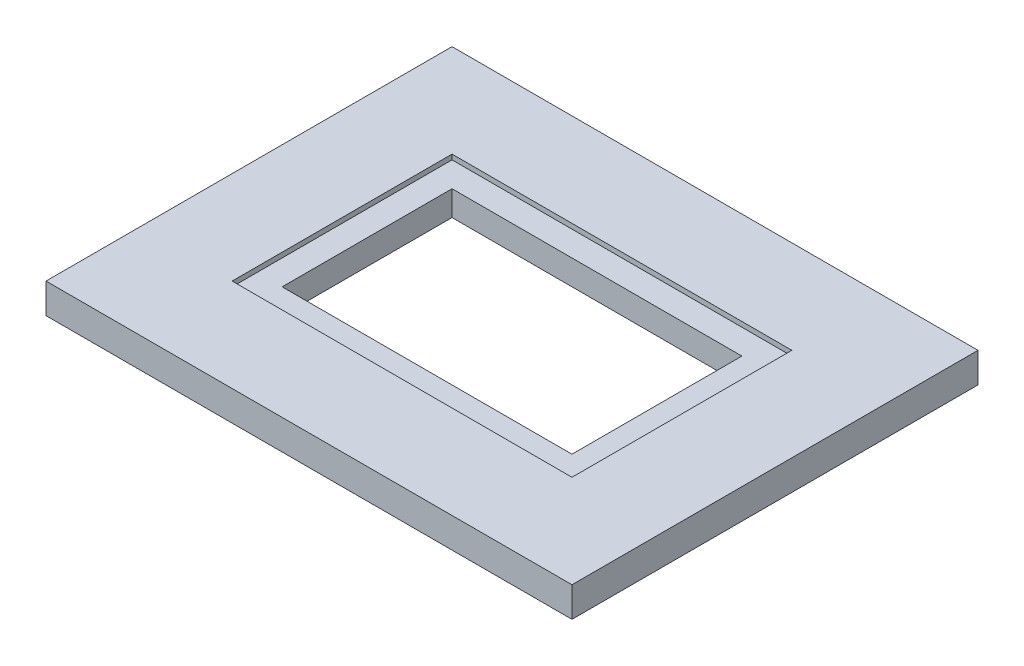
ISO-10303-21;
HEADER;
FILE_DESCRIPTION(('STEP AP214'),'2;1');
FILE_NAME('part.step','',(''),(''),'','','');
FILE_SCHEMA(('AUTOMOTIVE_DESIGN { 1 0 10303 214 1 1 1 1 }'));
ENDSEC;
DATA;
#1=APPLICATION_CONTEXT('core data for automotive mechanical design processes');
#2=APPLICATION_PROTOCOL_DEFINITION('international standard','automotive_design',2000,#1);
#3=PRODUCT_CONTEXT('',#1,'mechanical');
#4=PRODUCT('Part','Part','',(#3));
#5=PRODUCT_RELATED_PRODUCT_CATEGORY('part','',(#4));
#6=PRODUCT_DEFINITION_FORMATION('','',#4);
#7=PRODUCT_DEFINITION_CONTEXT('part definition',#1,'design');
#8=PRODUCT_DEFINITION('design','',#6,#7);
#9=PRODUCT_DEFINITION_SHAPE('','',#8);
#10=(LENGTH_UNIT() NAMED_UNIT(*) SI_UNIT(.MILLI.,.METRE.));
#11=(NAMED_UNIT(*) PLANE_ANGLE_UNIT() SI_UNIT($,.RADIAN.));
#12=(NAMED_UNIT(*) SI_UNIT($,.STERADIAN.) SOLID_ANGLE_UNIT());
#13=UNCERTAINTY_MEASURE_WITH_UNIT(LENGTH_MEASURE(1.E-05),#10,'distance_accuracy_value','');
#14=(GEOMETRIC_REPRESENTATION_CONTEXT(3) GLOBAL_UNCERTAINTY_ASSIGNED_CONTEXT((#13)) GLOBAL_UNIT_ASSIGNED_CONTEXT((#10,
#11,#12)) REPRESENTATION_CONTEXT('',''));
#15=CARTESIAN_POINT('',(0.,0.,0.));
#16=DIRECTION('',(0.,0.,1.));
#17=DIRECTION('',(1.,0.,0.));
#18=AXIS2_PLACEMENT_3D('',#15,#16,#17);
#19=CARTESIAN_POINT('',(-92.075,19.05,53.975));
#20=DIRECTION('',(1.,0.,0.));
#21=DIRECTION('',(0.,0.,-1.));
#22=AXIS2_PLACEMENT_3D('',#19,#20,#21);
#23=PLANE('',#22);
#24=DIRECTION('',(0.,-1.,0.));
#25=VECTOR('',#24,1.);
#26=CARTESIAN_POINT('',(-92.075,19.05,-53.975));
#27=LINE('',#26,#25);
#28=CARTESIAN_POINT('',(-92.075,15.875,-53.975));
#29=VERTEX_POINT('',#28);
#30=CARTESIAN_POINT('',(-92.075,0.,-53.975));
#31=VERTEX_POINT('',#30);
#32=EDGE_CURVE('E133',#29,#31,#27,.T.);
#33=ORIENTED_EDGE('',*,*,#32,.F.);
#34=DIRECTION('',(0.,0.,1.));
#35=VECTOR('',#34,1.);
#36=CARTESIAN_POINT('',(-92.075,15.875,-53.975));
#37=LINE('',#36,#35);
#38=CARTESIAN_POINT('',(-92.075,15.875,53.975));
#39=VERTEX_POINT('',#38);
#40=EDGE_CURVE('E55',#29,#39,#37,.T.);
#41=ORIENTED_EDGE('',*,*,#40,.T.);
#42=DIRECTION('',(0.,-1.,0.));
#43=VECTOR('',#42,1.);
#44=CARTESIAN_POINT('',(-92.075,19.05,53.975));
#45=LINE('',#44,#43);
#46=CARTESIAN_POINT('',(-92.075,0.,53.975));
#47=VERTEX_POINT('',#46);
#48=EDGE_CURVE('E131',#39,#47,#45,.T.);
#49=ORIENTED_EDGE('',*,*,#48,.T.);
#50=DIRECTION('',(0.,0.,1.));
#51=VECTOR('',#50,1.);
#52=CARTESIAN_POINT('',(-92.075,0.,53.975));
#53=LINE('',#52,#51);
#54=EDGE_CURVE('E243',#31,#47,#53,.T.);
#55=ORIENTED_EDGE('',*,*,#54,.F.);
#56=EDGE_LOOP('',(#33,#41,#49,#55));
#57=FACE_BOUND('',#56,.T.);
#58=ADVANCED_FACE('F32',(#57),#23,.T.);
#59=CARTESIAN_POINT('',(92.075,19.05,53.975));
#60=DIRECTION('',(0.,0.,-1.));
#61=DIRECTION('',(-1.,0.,0.));
#62=AXIS2_PLACEMENT_3D('',#59,#60,#61);
#63=PLANE('',#62);
#64=ORIENTED_EDGE('',*,*,#48,.F.);
#65=DIRECTION('',(1.,0.,0.));
#66=VECTOR('',#65,1.);
#67=CARTESIAN_POINT('',(-92.075,15.875,53.975));
#68=LINE('',#67,#66);
#69=CARTESIAN_POINT('',(92.075,15.875,53.975));
#70=VERTEX_POINT('',#69);
#71=EDGE_CURVE('E119',#39,#70,#68,.T.);
#72=ORIENTED_EDGE('',*,*,#71,.T.);
#73=DIRECTION('',(0.,-1.,0.));
#74=VECTOR('',#73,1.);
#75=CARTESIAN_POINT('',(92.075,19.05,53.975));
#76=LINE('',#75,#74);
#77=CARTESIAN_POINT('',(92.075,0.,53.975));
#78=VERTEX_POINT('',#77);
#79=EDGE_CURVE('E140',#70,#78,#76,.T.);
#80=ORIENTED_EDGE('',*,*,#79,.T.);
#81=DIRECTION('',(1.,0.,0.));
#82=VECTOR('',#81,1.);
#83=CARTESIAN_POINT('',(92.075,0.,53.975));
#84=LINE('',#83,#82);
#85=EDGE_CURVE('E137',#47,#78,#84,.T.);
#86=ORIENTED_EDGE('',*,*,#85,.F.);
#87=EDGE_LOOP('',(#64,#72,#80,#86));
#88=FACE_BOUND('',#87,.T.);
#89=ADVANCED_FACE('F135',(#88),#63,.T.);
#90=CARTESIAN_POINT('',(92.075,19.05,53.975));
#91=DIRECTION('',(-1.,0.,0.));
#92=DIRECTION('',(0.,0.,1.));
#93=AXIS2_PLACEMENT_3D('',#90,#91,#92);
#94=PLANE('',#93);
#95=ORIENTED_EDGE('',*,*,#79,.F.);
#96=DIRECTION('',(0.,0.,-1.));
#97=VECTOR('',#96,1.);
#98=CARTESIAN_POINT('',(92.075,15.875,-53.975));
#99=LINE('',#98,#97);
#100=CARTESIAN_POINT('',(92.075,15.875,-53.975));
#101=VERTEX_POINT('',#100);
#102=EDGE_CURVE('E123',#70,#101,#99,.T.);
#103=ORIENTED_EDGE('',*,*,#102,.T.);
#104=DIRECTION('',(0.,-1.,0.));
#105=VECTOR('',#104,1.);
#106=CARTESIAN_POINT('',(92.075,19.05,-53.975));
#107=LINE('',#106,#105);
#108=CARTESIAN_POINT('',(92.075,0.,-53.975));
#109=VERTEX_POINT('',#108);
#110=EDGE_CURVE('E145',#101,#109,#107,.T.);
#111=ORIENTED_EDGE('',*,*,#110,.T.);
#112=DIRECTION('',(0.,0.,-1.));
#113=VECTOR('',#112,1.);
#114=CARTESIAN_POINT('',(92.075,0.,53.975));
#115=LINE('',#114,#113);
#116=EDGE_CURVE('E238',#78,#109,#115,.T.);
#117=ORIENTED_EDGE('',*,*,#116,.F.);
#118=EDGE_LOOP('',(#95,#103,#111,#117));
#119=FACE_BOUND('',#118,.T.);
#120=ADVANCED_FACE('F202',(#119),#94,.T.);
#121=CARTESIAN_POINT('',(92.075,19.05,-53.975));
#122=DIRECTION('',(0.,0.,1.));
#123=DIRECTION('',(1.,0.,0.));
#124=AXIS2_PLACEMENT_3D('',#121,#122,#123);
#125=PLANE('',#124);
#126=ORIENTED_EDGE('',*,*,#110,.F.);
#127=DIRECTION('',(-1.,0.,0.));
#128=VECTOR('',#127,1.);
#129=CARTESIAN_POINT('',(-92.075,15.875,-53.975));
#130=LINE('',#129,#128);
#131=EDGE_CURVE('E250',#101,#29,#130,.T.);
#132=ORIENTED_EDGE('',*,*,#131,.T.);
#133=ORIENTED_EDGE('',*,*,#32,.T.);
#134=DIRECTION('',(-1.,0.,0.));
#135=VECTOR('',#134,1.);
#136=CARTESIAN_POINT('',(92.075,0.,-53.975));
#137=LINE('',#136,#135);
#138=EDGE_CURVE('E241',#109,#31,#137,.T.);
#139=ORIENTED_EDGE('',*,*,#138,.F.);
#140=EDGE_LOOP('',(#126,#132,#133,#139));
#141=FACE_BOUND('',#140,.T.);
#142=ADVANCED_FACE('F208',(#141),#125,.T.);
#143=CARTESIAN_POINT('',(0.,19.05,0.));
#144=DIRECTION('',(0.,1.,0.));
#145=DIRECTION('',(0.,0.,1.));
#146=AXIS2_PLACEMENT_3D('',#143,#144,#145);
#147=PLANE('',#146);
#148=DIRECTION('',(0.,0.,1.));
#149=VECTOR('',#148,1.);
#150=CARTESIAN_POINT('',(-107.95,19.05,-69.85));
#151=LINE('',#150,#149);
#152=CARTESIAN_POINT('',(-107.95,19.05,-69.85));
#153=VERTEX_POINT('',#152);
#154=CARTESIAN_POINT('',(-107.95,19.05,69.85));
#155=VERTEX_POINT('',#154);
#156=EDGE_CURVE('E47',#153,#155,#151,.T.);
#157=ORIENTED_EDGE('',*,*,#156,.F.);
#158=DIRECTION('',(-1.,0.,0.));
#159=VECTOR('',#158,1.);
#160=CARTESIAN_POINT('',(-107.95,19.05,-69.85));
#161=LINE('',#160,#159);
#162=CARTESIAN_POINT('',(107.95,19.05,-69.85));
#163=VERTEX_POINT('',#162);
#164=EDGE_CURVE('E260',#163,#153,#161,.T.);
#165=ORIENTED_EDGE('',*,*,#164,.F.);
#166=DIRECTION('',(0.,0.,-1.));
#167=VECTOR('',#166,1.);
#168=CARTESIAN_POINT('',(107.95,19.05,-69.85));
#169=LINE('',#168,#167);
#170=CARTESIAN_POINT('',(107.95,19.05,69.85));
#171=VERTEX_POINT('',#170);
#172=EDGE_CURVE('E272',#171,#163,#169,.T.);
#173=ORIENTED_EDGE('',*,*,#172,.F.);
#174=DIRECTION('',(1.,0.,0.));
#175=VECTOR('',#174,1.);
#176=CARTESIAN_POINT('',(-107.95,19.05,69.85));
#177=LINE('',#176,#175);
#178=EDGE_CURVE('E252',#155,#171,#177,.T.);
#179=ORIENTED_EDGE('',*,*,#178,.F.);
#180=EDGE_LOOP('',(#157,#165,#173,#179));
#181=FACE_BOUND('',#180,.T.);
#182=DIRECTION('',(0.,0.,1.));
#183=VECTOR('',#182,1.);
#184=CARTESIAN_POINT('',(-167.075,19.05,128.975));
#185=LINE('',#184,#183);
#186=CARTESIAN_POINT('',(-167.075,19.05,-128.975));
#187=VERTEX_POINT('',#186);
#188=CARTESIAN_POINT('',(-167.075,19.05,128.975));
#189=VERTEX_POINT('',#188);
#190=EDGE_CURVE('E149',#187,#189,#185,.T.);
#191=ORIENTED_EDGE('',*,*,#190,.T.);
#192=DIRECTION('',(1.,0.,0.));
#193=VECTOR('',#192,1.);
#194=CARTESIAN_POINT('',(167.075,19.05,128.975));
#195=LINE('',#194,#193);
#196=CARTESIAN_POINT('',(167.075,19.05,128.975));
#197=VERTEX_POINT('',#196);
#198=EDGE_CURVE('E152',#189,#197,#195,.T.);
#199=ORIENTED_EDGE('',*,*,#198,.T.);
#200=DIRECTION('',(0.,0.,-1.));
#201=VECTOR('',#200,1.);
#202=CARTESIAN_POINT('',(167.075,19.05,128.975));
#203=LINE('',#202,#201);
#204=CARTESIAN_POINT('',(167.075,19.05,-128.975));
#205=VERTEX_POINT('',#204);
#206=EDGE_CURVE('E155',#197,#205,#203,.T.);
#207=ORIENTED_EDGE('',*,*,#206,.T.);
#208=DIRECTION('',(-1.,0.,0.));
#209=VECTOR('',#208,1.);
#210=CARTESIAN_POINT('',(167.075,19.05,-128.975));
#211=LINE('',#210,#209);
#212=EDGE_CURVE('E157',#205,#187,#211,.T.);
#213=ORIENTED_EDGE('',*,*,#212,.T.);
#214=EDGE_LOOP('',(#191,#199,#207,#213));
#215=FACE_BOUND('',#214,.T.);
#216=ADVANCED_FACE('F189',(#181,#215),#147,.T.);
#217=CARTESIAN_POINT('',(0.,0.,0.));
#218=DIRECTION('',(0.,1.,0.));
#219=DIRECTION('',(0.,0.,1.));
#220=AXIS2_PLACEMENT_3D('',#217,#218,#219);
#221=PLANE('',#220);
#222=DIRECTION('',(0.,0.,1.));
#223=VECTOR('',#222,1.);
#224=CARTESIAN_POINT('',(-167.075,0.,128.975));
#225=LINE('',#224,#223);
#226=CARTESIAN_POINT('',(-167.075,0.,-128.975));
#227=VERTEX_POINT('',#226);
#228=CARTESIAN_POINT('',(-167.075,0.,128.975));
#229=VERTEX_POINT('',#228);
#230=EDGE_CURVE('E139',#227,#229,#225,.T.);
#231=ORIENTED_EDGE('',*,*,#230,.F.);
#232=DIRECTION('',(-1.,0.,0.));
#233=VECTOR('',#232,1.);
#234=CARTESIAN_POINT('',(167.075,0.,-128.975));
#235=LINE('',#234,#233);
#236=CARTESIAN_POINT('',(167.075,0.,-128.975));
#237=VERTEX_POINT('',#236);
#238=EDGE_CURVE('E153',#237,#227,#235,.T.);
#239=ORIENTED_EDGE('',*,*,#238,.F.);
#240=DIRECTION('',(0.,0.,-1.));
#241=VECTOR('',#240,1.);
#242=CARTESIAN_POINT('',(167.075,0.,128.975));
#243=LINE('',#242,#241);
#244=CARTESIAN_POINT('',(167.075,0.,128.975));
#245=VERTEX_POINT('',#244);
#246=EDGE_CURVE('E161',#245,#237,#243,.T.);
#247=ORIENTED_EDGE('',*,*,#246,.F.);
#248=DIRECTION('',(1.,0.,0.));
#249=VECTOR('',#248,1.);
#250=CARTESIAN_POINT('',(167.075,0.,128.975));
#251=LINE('',#250,#249);
#252=EDGE_CURVE('E143',#229,#245,#251,.T.);
#253=ORIENTED_EDGE('',*,*,#252,.F.);
#254=EDGE_LOOP('',(#231,#239,#247,#253));
#255=FACE_BOUND('',#254,.T.);
#256=ORIENTED_EDGE('',*,*,#54,.T.);
#257=ORIENTED_EDGE('',*,*,#85,.T.);
#258=ORIENTED_EDGE('',*,*,#116,.T.);
#259=ORIENTED_EDGE('',*,*,#138,.T.);
#260=EDGE_LOOP('',(#256,#257,#258,#259));
#261=FACE_BOUND('',#260,.T.);
#262=ADVANCED_FACE('F179',(#255,#261),#221,.F.);
#263=CARTESIAN_POINT('',(-167.075,19.05,128.975));
#264=DIRECTION('',(1.,0.,0.));
#265=DIRECTION('',(0.,0.,-1.));
#266=AXIS2_PLACEMENT_3D('',#263,#264,#265);
#267=PLANE('',#266);
#268=ORIENTED_EDGE('',*,*,#230,.T.);
#269=DIRECTION('',(0.,-1.,0.));
#270=VECTOR('',#269,1.);
#271=CARTESIAN_POINT('',(-167.075,19.05,128.975));
#272=LINE('',#271,#270);
#273=EDGE_CURVE('E11',#189,#229,#272,.T.);
#274=ORIENTED_EDGE('',*,*,#273,.F.);
#275=ORIENTED_EDGE('',*,*,#190,.F.);
#276=DIRECTION('',(0.,-1.,0.));
#277=VECTOR('',#276,1.);
#278=CARTESIAN_POINT('',(-167.075,19.05,-128.975));
#279=LINE('',#278,#277);
#280=EDGE_CURVE('E158',#187,#227,#279,.T.);
#281=ORIENTED_EDGE('',*,*,#280,.T.);
#282=EDGE_LOOP('',(#268,#274,#275,#281));
#283=FACE_BOUND('',#282,.T.);
#284=ADVANCED_FACE('F34',(#283),#267,.F.);
#285=CARTESIAN_POINT('',(167.075,19.05,128.975));
#286=DIRECTION('',(0.,0.,-1.));
#287=DIRECTION('',(-1.,0.,0.));
#288=AXIS2_PLACEMENT_3D('',#285,#286,#287);
#289=PLANE('',#288);
#290=ORIENTED_EDGE('',*,*,#252,.T.);
#291=DIRECTION('',(0.,-1.,0.));
#292=VECTOR('',#291,1.);
#293=CARTESIAN_POINT('',(167.075,19.05,128.975));
#294=LINE('',#293,#292);
#295=EDGE_CURVE('E40',#197,#245,#294,.T.);
#296=ORIENTED_EDGE('',*,*,#295,.F.);
#297=ORIENTED_EDGE('',*,*,#198,.F.);
#298=ORIENTED_EDGE('',*,*,#273,.T.);
#299=EDGE_LOOP('',(#290,#296,#297,#298));
#300=FACE_BOUND('',#299,.T.);
#301=ADVANCED_FACE('F190',(#300),#289,.F.);
#302=CARTESIAN_POINT('',(167.075,19.05,128.975));
#303=DIRECTION('',(-1.,0.,0.));
#304=DIRECTION('',(0.,0.,1.));
#305=AXIS2_PLACEMENT_3D('',#302,#303,#304);
#306=PLANE('',#305);
#307=ORIENTED_EDGE('',*,*,#246,.T.);
#308=DIRECTION('',(0.,-1.,0.));
#309=VECTOR('',#308,1.);
#310=CARTESIAN_POINT('',(167.075,19.05,-128.975));
#311=LINE('',#310,#309);
#312=EDGE_CURVE('E166',#205,#237,#311,.T.);
#313=ORIENTED_EDGE('',*,*,#312,.F.);
#314=ORIENTED_EDGE('',*,*,#206,.F.);
#315=ORIENTED_EDGE('',*,*,#295,.T.);
#316=EDGE_LOOP('',(#307,#313,#314,#315));
#317=FACE_BOUND('',#316,.T.);
#318=ADVANCED_FACE('F173',(#317),#306,.F.);
#319=CARTESIAN_POINT('',(167.075,19.05,-128.975));
#320=DIRECTION('',(0.,0.,1.));
#321=DIRECTION('',(1.,0.,0.));
#322=AXIS2_PLACEMENT_3D('',#319,#320,#321);
#323=PLANE('',#322);
#324=ORIENTED_EDGE('',*,*,#238,.T.);
#325=ORIENTED_EDGE('',*,*,#280,.F.);
#326=ORIENTED_EDGE('',*,*,#212,.F.);
#327=ORIENTED_EDGE('',*,*,#312,.T.);
#328=EDGE_LOOP('',(#324,#325,#326,#327));
#329=FACE_BOUND('',#328,.T.);
#330=ADVANCED_FACE('F183',(#329),#323,.F.);
#331=CARTESIAN_POINT('',(-107.95,15.875,-69.85));
#332=DIRECTION('',(-1.,0.,0.));
#333=DIRECTION('',(0.,0.,1.));
#334=AXIS2_PLACEMENT_3D('',#331,#332,#333);
#335=PLANE('',#334);
#336=ORIENTED_EDGE('',*,*,#156,.T.);
#337=DIRECTION('',(0.,1.,0.));
#338=VECTOR('',#337,1.);
#339=CARTESIAN_POINT('',(-107.95,15.875,69.85));
#340=LINE('',#339,#338);
#341=CARTESIAN_POINT('',(-107.95,15.875,69.85));
#342=VERTEX_POINT('',#341);
#343=EDGE_CURVE('E268',#342,#155,#340,.T.);
#344=ORIENTED_EDGE('',*,*,#343,.F.);
#345=DIRECTION('',(0.,0.,1.));
#346=VECTOR('',#345,1.);
#347=CARTESIAN_POINT('',(-107.95,15.875,-69.85));
#348=LINE('',#347,#346);
#349=CARTESIAN_POINT('',(-107.95,15.875,-69.85));
#350=VERTEX_POINT('',#349);
#351=EDGE_CURVE('E256',#350,#342,#348,.T.);
#352=ORIENTED_EDGE('',*,*,#351,.F.);
#353=DIRECTION('',(0.,1.,0.));
#354=VECTOR('',#353,1.);
#355=CARTESIAN_POINT('',(-107.95,15.875,-69.85));
#356=LINE('',#355,#354);
#357=EDGE_CURVE('E245',#350,#153,#356,.T.);
#358=ORIENTED_EDGE('',*,*,#357,.T.);
#359=EDGE_LOOP('',(#336,#344,#352,#358));
#360=FACE_BOUND('',#359,.T.);
#361=ADVANCED_FACE('F213',(#360),#335,.F.);
#362=CARTESIAN_POINT('',(-107.95,15.875,-69.85));
#363=DIRECTION('',(0.,0.,-1.));
#364=DIRECTION('',(-1.,0.,0.));
#365=AXIS2_PLACEMENT_3D('',#362,#363,#364);
#366=PLANE('',#365);
#367=ORIENTED_EDGE('',*,*,#164,.T.);
#368=ORIENTED_EDGE('',*,*,#357,.F.);
#369=DIRECTION('',(-1.,0.,0.));
#370=VECTOR('',#369,1.);
#371=CARTESIAN_POINT('',(-107.95,15.875,-69.85));
#372=LINE('',#371,#370);
#373=CARTESIAN_POINT('',(107.95,15.875,-69.85));
#374=VERTEX_POINT('',#373);
#375=EDGE_CURVE('E266',#374,#350,#372,.T.);
#376=ORIENTED_EDGE('',*,*,#375,.F.);
#377=DIRECTION('',(0.,1.,0.));
#378=VECTOR('',#377,1.);
#379=CARTESIAN_POINT('',(107.95,15.875,-69.85));
#380=LINE('',#379,#378);
#381=EDGE_CURVE('E278',#374,#163,#380,.T.);
#382=ORIENTED_EDGE('',*,*,#381,.T.);
#383=EDGE_LOOP('',(#367,#368,#376,#382));
#384=FACE_BOUND('',#383,.T.);
#385=ADVANCED_FACE('F217',(#384),#366,.F.);
#386=CARTESIAN_POINT('',(107.95,15.875,-69.85));
#387=DIRECTION('',(1.,0.,0.));
#388=DIRECTION('',(0.,0.,-1.));
#389=AXIS2_PLACEMENT_3D('',#386,#387,#388);
#390=PLANE('',#389);
#391=ORIENTED_EDGE('',*,*,#172,.T.);
#392=ORIENTED_EDGE('',*,*,#381,.F.);
#393=DIRECTION('',(0.,0.,-1.));
#394=VECTOR('',#393,1.);
#395=CARTESIAN_POINT('',(107.95,15.875,-69.85));
#396=LINE('',#395,#394);
#397=CARTESIAN_POINT('',(107.95,15.875,69.85));
#398=VERTEX_POINT('',#397);
#399=EDGE_CURVE('E263',#398,#374,#396,.T.);
#400=ORIENTED_EDGE('',*,*,#399,.F.);
#401=DIRECTION('',(0.,1.,0.));
#402=VECTOR('',#401,1.);
#403=CARTESIAN_POINT('',(107.95,15.875,69.85));
#404=LINE('',#403,#402);
#405=EDGE_CURVE('E280',#398,#171,#404,.T.);
#406=ORIENTED_EDGE('',*,*,#405,.T.);
#407=EDGE_LOOP('',(#391,#392,#400,#406));
#408=FACE_BOUND('',#407,.T.);
#409=ADVANCED_FACE('F222',(#408),#390,.F.);
#410=CARTESIAN_POINT('',(-107.95,15.875,69.85));
#411=DIRECTION('',(0.,0.,1.));
#412=DIRECTION('',(1.,0.,0.));
#413=AXIS2_PLACEMENT_3D('',#410,#411,#412);
#414=PLANE('',#413);
#415=ORIENTED_EDGE('',*,*,#178,.T.);
#416=ORIENTED_EDGE('',*,*,#405,.F.);
#417=DIRECTION('',(1.,0.,0.));
#418=VECTOR('',#417,1.);
#419=CARTESIAN_POINT('',(-107.95,15.875,69.85));
#420=LINE('',#419,#418);
#421=EDGE_CURVE('E259',#342,#398,#420,.T.);
#422=ORIENTED_EDGE('',*,*,#421,.F.);
#423=ORIENTED_EDGE('',*,*,#343,.T.);
#424=EDGE_LOOP('',(#415,#416,#422,#423));
#425=FACE_BOUND('',#424,.T.);
#426=ADVANCED_FACE('F227',(#425),#414,.F.);
#427=CARTESIAN_POINT('',(0.,15.875,0.));
#428=DIRECTION('',(0.,1.,0.));
#429=DIRECTION('',(0.,0.,1.));
#430=AXIS2_PLACEMENT_3D('',#427,#428,#429);
#431=PLANE('',#430);
#432=ORIENTED_EDGE('',*,*,#131,.F.);
#433=ORIENTED_EDGE('',*,*,#102,.F.);
#434=ORIENTED_EDGE('',*,*,#71,.F.);
#435=ORIENTED_EDGE('',*,*,#40,.F.);
#436=EDGE_LOOP('',(#432,#433,#434,#435));
#437=FACE_BOUND('',#436,.T.);
#438=ORIENTED_EDGE('',*,*,#351,.T.);
#439=ORIENTED_EDGE('',*,*,#421,.T.);
#440=ORIENTED_EDGE('',*,*,#399,.T.);
#441=ORIENTED_EDGE('',*,*,#375,.T.);
#442=EDGE_LOOP('',(#438,#439,#440,#441));
#443=FACE_BOUND('',#442,.T.);
#444=ADVANCED_FACE('F120',(#437,#443),#431,.T.);
#445=CLOSED_SHELL('',(#58,#89,#120,#142,#216,#262,#284,#301,#318,#330,#361,#385,#409,#426,#444));
#446=MANIFOLD_SOLID_BREP('B2',#445);
#447=ADVANCED_BREP_SHAPE_REPRESENTATION('',(#18,#446),#14);
#448=SHAPE_DEFINITION_REPRESENTATION(#9,#447);
ENDSEC;
END-ISO-10303-21;
